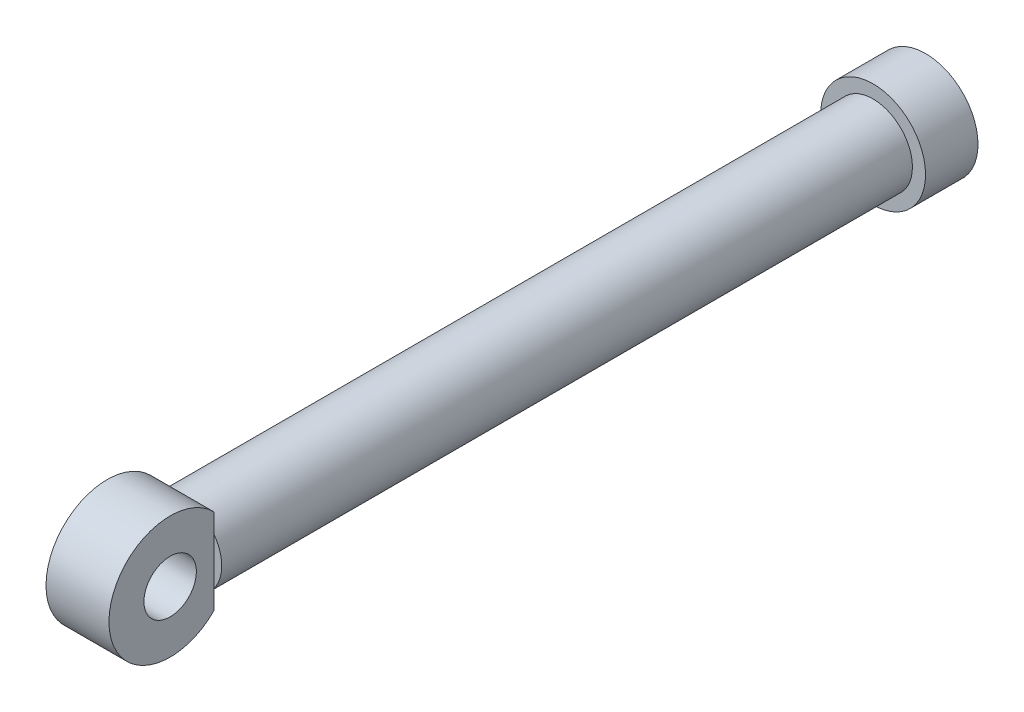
from build123d import *

# Parameters (mm, degrees)
SKETCH_1_R      = 30
EXTRUDE_1_DEPTH = 30
SKETCH_2_R      = 22.5
EXTRUDE_2_DEPTH = 395
SKETCH_3_R      = 15
EXTRUDE_3_DEPTH = 18


with BuildPart() as part:
    # Sketch 1 → Extrude 1 (new body)
    with BuildSketch(Plane.XY):
        Circle(SKETCH_1_R)
    extrude(amount=EXTRUDE_1_DEPTH)

    # Sketch 2 → Extrude 2 (add)
    with BuildSketch(Plane.XY.offset(30)):
        with Locations(Location((0, 0, 0), (0, 0, 180))):
            Circle(SKETCH_2_R)
    extrude(amount=EXTRUDE_2_DEPTH)

    # Sketch 3 → Extrude 3 (add, symmetric)
    with BuildSketch(Plane(origin=(0, 0, 0), x_dir=(0, 0, -1), z_dir=(1, 0, 0))):
        with BuildLine():
            Line((-425, 24.494897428), (-425, -24.494897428))
            ThreePointArc((-425, -24.494897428), (-485, 0), (-425, 24.494897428))
        make_face()
        with Locations((-450, 0)):
            Circle(SKETCH_3_R, mode=Mode.SUBTRACT)
    extrude(amount=EXTRUDE_3_DEPTH, both=True)


solid = part.part
